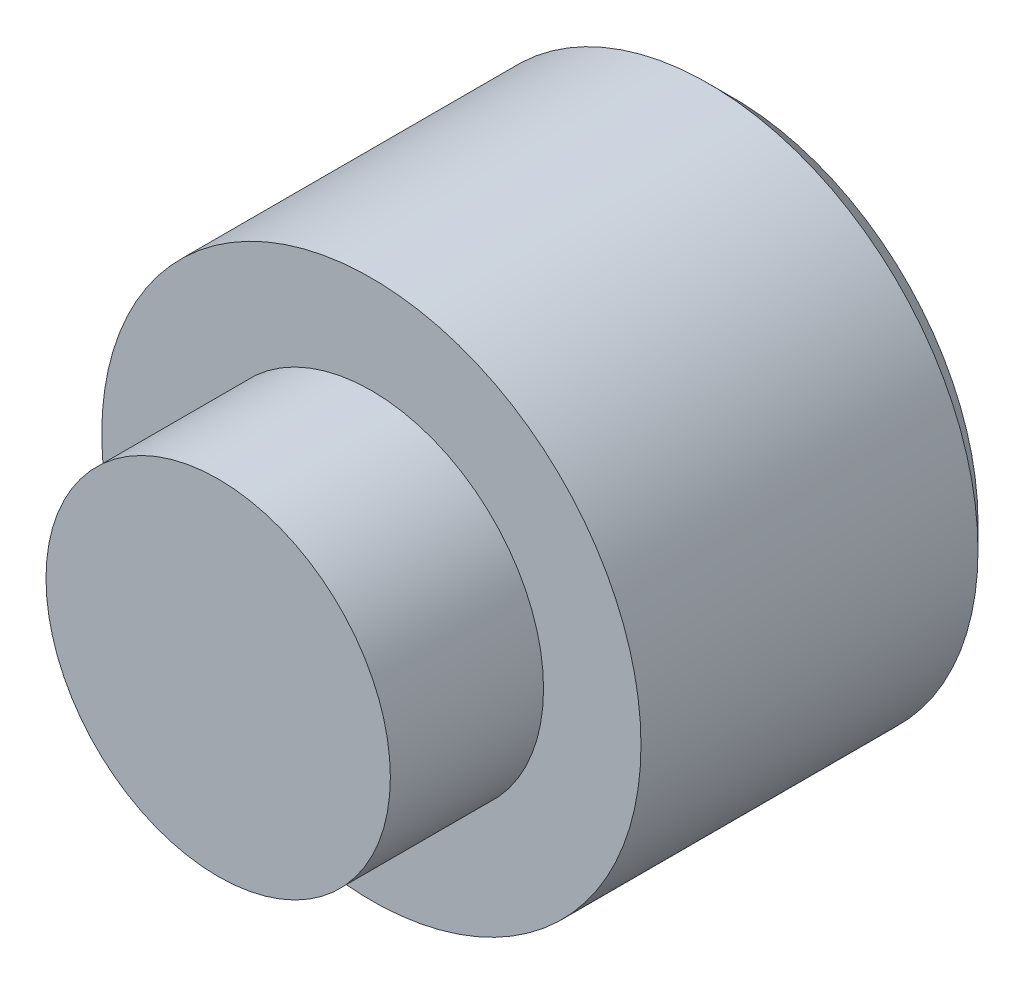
from build123d import *

# Parameters (mm, degrees)
SKETCH1_R           = 3.5687
BOSS_EXTRUDE1_DEPTH = 3.175
SKETCH2_R           = 5.588
BOSS_EXTRUDE2_DEPTH = 7.493
CHAMFER1_SIZE       = 0.508


with BuildPart() as part:
    # Sketch1 → Boss-Extrude1 (new body)
    with BuildSketch(Plane.XY):
        Circle(SKETCH1_R)
    extrude(amount=BOSS_EXTRUDE1_DEPTH)

    # Sketch2 → Boss-Extrude2 (add)
    with BuildSketch(Plane(origin=(0, 0, 0), x_dir=(-1, 0, 0), z_dir=(0, 0, -1))):
        Circle(SKETCH2_R)
    extrude(amount=BOSS_EXTRUDE2_DEPTH)

    # Chamfer1
    chamfer1_edges = [part.edges().sort_by_distance(p)[0] for p in [
        (5.588, 0, -7.493),
    ]]
    chamfer(chamfer1_edges, length=CHAMFER1_SIZE)


solid = part.part
